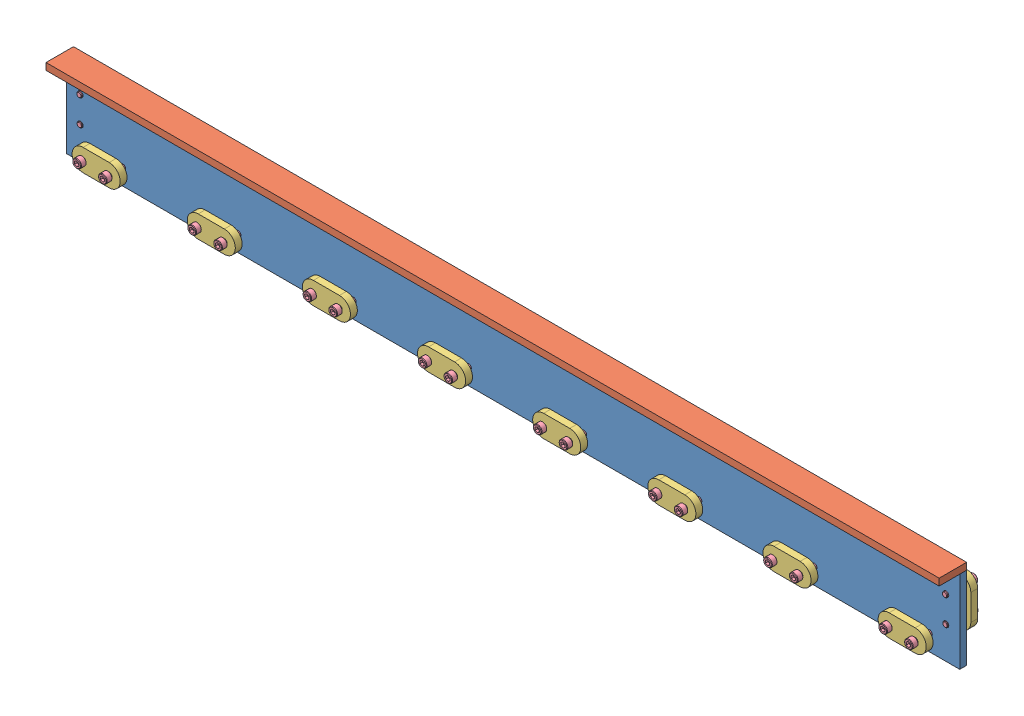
SolidWorks assembly fs-ua-right-mount-assembly-with-screws.SLDASM, configuration Default (file format 9000). Lengths in mm.
Overall size (825.5 82.55 45.12).
33 component instances, 4 part files, 6 mates.
Components (placement in the parent):
- fs-ua-right-mount-assembly-1: fs-ua-right-mount-assembly.SLDASM [Default] at origin size (825.5 82.55 38.15)
  - fs-ua-right-mount-vertical-component-1: fs-ua-right-mount-vertical-component.SLDPRT [Default] at origin size (825.5 76.2 6.35)
  - fs-ua-right-mount-horizontal-component-1: fs-ua-right-mount-horizontal-component.SLDPRT [Default] at (412.75 76.2 12.7) size (825.5 6.35 25.4)
  - fs-clamp-1: fs-clamp.SLDPRT [Default] at (27.94 15.24 12.7326) size (44.45 20.32 6.35)
  - fs-clamp-11: fs-clamp.SLDPRT [Default] at (12.7 29.845 -12.7409) x (0 1 0) z (0 0 1) size (44.45 20.32 6.35)
  - fs-clamp-12: fs-clamp.SLDPRT [Default] at (812.8 29.845 -6.3972) x (0 1 0) z (0 0 -1) size (44.45 20.32 6.35)
  - fs-clamp-4: fs-clamp.SLDPRT [Default] at (134.366 15.24 12.7326) size (44.45 20.32 6.35)
  - fs-clamp-5: fs-clamp.SLDPRT [Default] at (240.792 15.24 12.7326) size (44.45 20.32 6.35)
  - fs-clamp-6: fs-clamp.SLDPRT [Default] at (347.218 15.24 12.7326) size (44.45 20.32 6.35)
  - fs-clamp-7: fs-clamp.SLDPRT [Default] at (453.644 15.24 12.7326) size (44.45 20.32 6.35)
  - fs-clamp-8: fs-clamp.SLDPRT [Default] at (560.07 15.24 12.7326) size (44.45 20.32 6.35)
  - fs-clamp-9: fs-clamp.SLDPRT [Default] at (666.496 15.24 12.7326) size (44.45 20.32 6.35)
  - fs-clamp-10: fs-clamp.SLDPRT [Default] at (772.922 15.24 12.7326) size (44.45 20.32 6.35)
- socket head cap screw_ai-1: socket head cap screw_ai.sldprt [HX-SHCS 0.19-32x0.875x0.875-N] at (52.07 15.24 25.3347) x (0 0 -1) z (0.61191 -0.790927 0) size (27.05 7.94 7.94)
- socket head cap screw_ai-2: socket head cap screw_ai.sldprt [HX-SHCS 0.19-32x0.875x0.875-N] at (12.7 29.845 -19.6757) x (0 0 1) z (-0.841681 -0.539975 0) size (27.05 7.94 7.94)
- socket head cap screw_ai-3: socket head cap screw_ai.sldprt [HX-SHCS 0.19-32x0.875x0.875-N] at (12.7 53.975 -19.387) x (0 0 1) z (0.231262 0.972891 0) size (27.05 7.94 7.94)
- socket head cap screw_ai-4: socket head cap screw_ai.sldprt [HX-SHCS 0.19-32x0.875x0.875-N] at (812.8 29.845 -19.7235) x (0 0 1) z (-0.178736 -0.983897 0) size (27.05 7.94 7.94)
- socket head cap screw_ai-5: socket head cap screw_ai.sldprt [HX-SHCS 0.19-32x0.875x0.875-N] at (812.8 53.975 -19.4006) x (0 0 1) z (-0.954871 -0.29702 0) size (27.05 7.94 7.94)
- socket head cap screw_ai-6: socket head cap screw_ai.sldprt [HX-SHCS 0.19-32x0.875x0.875-N] at (27.94 15.24 25.0524) x (0 0 -1) z (-0.570283 0.821448 0) size (27.05 7.94 7.94)
- socket head cap screw_ai-7: socket head cap screw_ai.sldprt [HX-SHCS 0.19-32x0.875x0.875-N] at (134.366 15.24 25.0524) x (0 0 -1) z (-0.570283 0.821448 0) size (27.05 7.94 7.94)
- socket head cap screw_ai-8: socket head cap screw_ai.sldprt [HX-SHCS 0.19-32x0.875x0.875-N] at (240.792 15.24 25.0524) x (0 0 -1) z (-0.570283 0.821448 0) size (27.05 7.94 7.94)
- socket head cap screw_ai-9: socket head cap screw_ai.sldprt [HX-SHCS 0.19-32x0.875x0.875-N] at (347.218 15.24 25.0524) x (0 0 -1) z (-0.570283 0.821448 0) size (27.05 7.94 7.94)
- socket head cap screw_ai-10: socket head cap screw_ai.sldprt [HX-SHCS 0.19-32x0.875x0.875-N] at (453.644 15.24 25.0524) x (0 0 -1) z (-0.570283 0.821448 0) size (27.05 7.94 7.94)
- socket head cap screw_ai-11: socket head cap screw_ai.sldprt [HX-SHCS 0.19-32x0.875x0.875-N] at (560.07 15.24 25.0524) x (0 0 -1) z (-0.570283 0.821448 0) size (27.05 7.94 7.94)
- socket head cap screw_ai-12: socket head cap screw_ai.sldprt [HX-SHCS 0.19-32x0.875x0.875-N] at (666.496 15.24 25.0524) x (0 0 -1) z (-0.570283 0.821448 0) size (27.05 7.94 7.94)
- socket head cap screw_ai-13: socket head cap screw_ai.sldprt [HX-SHCS 0.19-32x0.875x0.875-N] at (772.922 15.24 25.0524) x (0 0 -1) z (-0.570283 0.821448 0) size (27.05 7.94 7.94)
- socket head cap screw_ai-14: socket head cap screw_ai.sldprt [HX-SHCS 0.19-32x0.875x0.875-N] at (158.496 15.24 25.3347) x (0 0 -1) z (0.61191 -0.790927 0) size (27.05 7.94 7.94)
- socket head cap screw_ai-15: socket head cap screw_ai.sldprt [HX-SHCS 0.19-32x0.875x0.875-N] at (264.922 15.24 25.3347) x (0 0 -1) z (0.61191 -0.790927 0) size (27.05 7.94 7.94)
- socket head cap screw_ai-16: socket head cap screw_ai.sldprt [HX-SHCS 0.19-32x0.875x0.875-N] at (371.348 15.24 25.3347) x (0 0 -1) z (0.61191 -0.790927 0) size (27.05 7.94 7.94)
- socket head cap screw_ai-17: socket head cap screw_ai.sldprt [HX-SHCS 0.19-32x0.875x0.875-N] at (477.774 15.24 25.3347) x (0 0 -1) z (0.61191 -0.790927 0) size (27.05 7.94 7.94)
- socket head cap screw_ai-18: socket head cap screw_ai.sldprt [HX-SHCS 0.19-32x0.875x0.875-N] at (584.2 15.24 25.3347) x (0 0 -1) z (0.61191 -0.790927 0) size (27.05 7.94 7.94)
- socket head cap screw_ai-19: socket head cap screw_ai.sldprt [HX-SHCS 0.19-32x0.875x0.875-N] at (690.626 15.24 25.3347) x (0 0 -1) z (0.61191 -0.790927 0) size (27.05 7.94 7.94)
- socket head cap screw_ai-20: socket head cap screw_ai.sldprt [HX-SHCS 0.19-32x0.875x0.875-N] at (797.052 15.24 25.3347) x (0 0 -1) z (0.61191 -0.790927 0) size (27.05 7.94 7.94)
Mates (geometry in assembly coordinates):
- Concentric1: concentric aligned: cylinder of fs-ua-right-mount-assembly-1/fs-clamp-11 through (12.7 29.845 -6.3909) axis (0 0 -1) radius 2.54; cylinder of socket head cap screw_ai-2 through (12.7 29.845 -51.4257) axis (0 0 -1) radius 2.413
- Concentric2: concentric aligned: cylinder of fs-ua-right-mount-assembly-1/fs-clamp-11 through (12.7 53.975 -6.3909) axis (0 0 -1) radius 2.54; cylinder of socket head cap screw_ai-3 through (12.7 53.975 -51.137) axis (0 0 -1) radius 2.413
- Concentric3: concentric anti-aligned: cylinder of fs-ua-right-mount-assembly-1/fs-clamp-1 through (27.94 15.24 19.0826) axis (0 0 -1) radius 2.54; cylinder of socket head cap screw_ai-6 through (27.94 15.24 56.8024) axis (0 0 1) radius 2.413
- Concentric4: concentric anti-aligned: cylinder of fs-ua-right-mount-assembly-1/fs-clamp-1 through (52.07 15.24 19.0826) axis (0 0 -1) radius 2.54; cylinder of socket head cap screw_ai-1 through (52.07 15.24 57.0847) axis (0 0 1) radius 2.413
- Concentric5: concentric anti-aligned: cylinder of fs-ua-right-mount-assembly-1/fs-clamp-12 through (812.8 53.975 -12.7472) axis (0 0 1) radius 2.54; cylinder of socket head cap screw_ai-5 through (812.8 53.975 -51.1506) axis (0 0 -1) radius 2.413
- Concentric6: concentric anti-aligned: cylinder of fs-ua-right-mount-assembly-1/fs-clamp-12 through (812.8 29.845 -12.7472) axis (0 0 1) radius 2.54; cylinder of socket head cap screw_ai-4 through (812.8 29.845 -51.4735) axis (0 0 -1) radius 2.413
